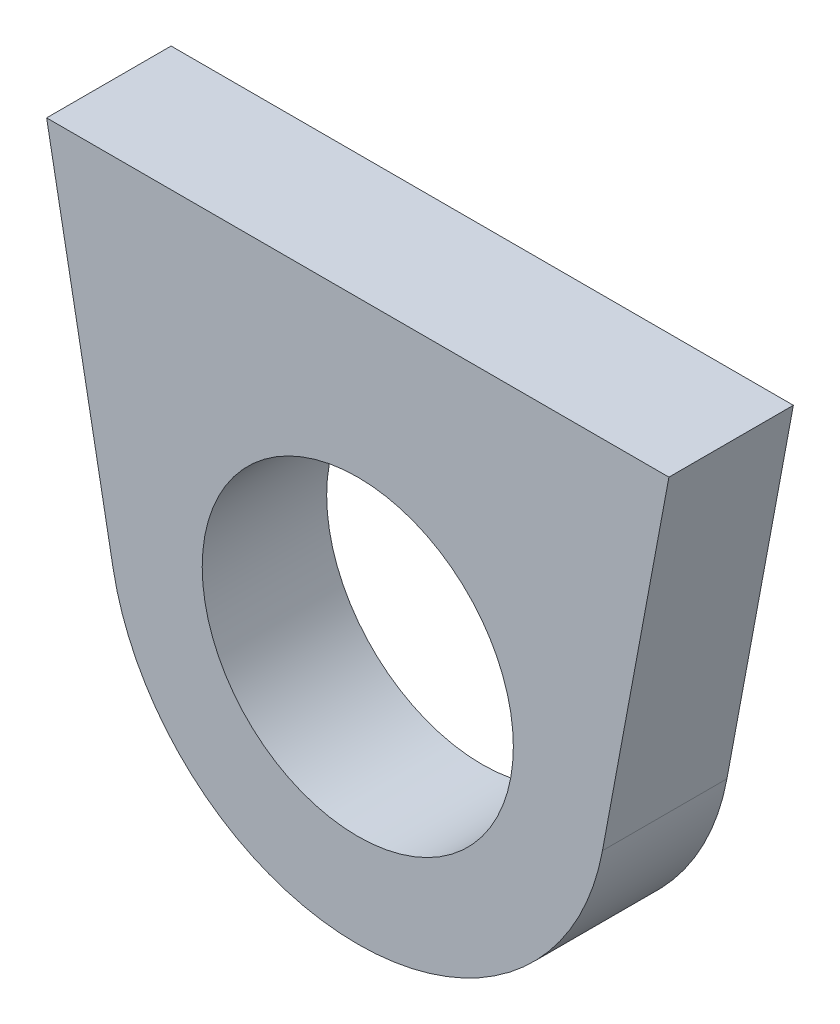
ISO-10303-21;
HEADER;
FILE_DESCRIPTION(('STEP AP214'),'2;1');
FILE_NAME('part.step','',(''),(''),'','','');
FILE_SCHEMA(('AUTOMOTIVE_DESIGN { 1 0 10303 214 1 1 1 1 }'));
ENDSEC;
DATA;
#1=APPLICATION_CONTEXT('core data for automotive mechanical design processes');
#2=APPLICATION_PROTOCOL_DEFINITION('international standard','automotive_design',2000,#1);
#3=PRODUCT_CONTEXT('',#1,'mechanical');
#4=PRODUCT('Part','Part','',(#3));
#5=PRODUCT_RELATED_PRODUCT_CATEGORY('part','',(#4));
#6=PRODUCT_DEFINITION_FORMATION('','',#4);
#7=PRODUCT_DEFINITION_CONTEXT('part definition',#1,'design');
#8=PRODUCT_DEFINITION('design','',#6,#7);
#9=PRODUCT_DEFINITION_SHAPE('','',#8);
#10=(LENGTH_UNIT() NAMED_UNIT(*) SI_UNIT(.MILLI.,.METRE.));
#11=(NAMED_UNIT(*) PLANE_ANGLE_UNIT() SI_UNIT($,.RADIAN.));
#12=(NAMED_UNIT(*) SI_UNIT($,.STERADIAN.) SOLID_ANGLE_UNIT());
#13=UNCERTAINTY_MEASURE_WITH_UNIT(LENGTH_MEASURE(1.E-05),#10,'distance_accuracy_value','');
#14=(GEOMETRIC_REPRESENTATION_CONTEXT(3) GLOBAL_UNCERTAINTY_ASSIGNED_CONTEXT((#13)) GLOBAL_UNIT_ASSIGNED_CONTEXT((#10,
#11,#12)) REPRESENTATION_CONTEXT('',''));
#15=CARTESIAN_POINT('',(0.,0.,0.));
#16=DIRECTION('',(0.,0.,1.));
#17=DIRECTION('',(1.,0.,0.));
#18=AXIS2_PLACEMENT_3D('',#15,#16,#17);
#19=CARTESIAN_POINT('',(0.,0.,40.));
#20=DIRECTION('',(0.,0.,1.));
#21=DIRECTION('',(1.,0.,0.));
#22=AXIS2_PLACEMENT_3D('',#19,#20,#21);
#23=PLANE('',#22);
#24=CARTESIAN_POINT('',(0.,0.,40.));
#25=DIRECTION('',(0.,0.,1.));
#26=DIRECTION('',(1.,0.,0.));
#27=AXIS2_PLACEMENT_3D('',#24,#25,#26);
#28=CIRCLE('',#27,80.);
#29=CARTESIAN_POINT('',(-78.6476151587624,-14.6476151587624,40.));
#30=VERTEX_POINT('',#29);
#31=CARTESIAN_POINT('',(78.6476151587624,-14.6476151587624,40.));
#32=VERTEX_POINT('',#31);
#33=EDGE_CURVE('E94',#30,#32,#28,.T.);
#34=ORIENTED_EDGE('',*,*,#33,.T.);
#35=DIRECTION('',(0.18309518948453,0.98309518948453,0.));
#36=VECTOR('',#35,1.);
#37=CARTESIAN_POINT('',(100.,100.,40.));
#38=LINE('',#37,#36);
#39=CARTESIAN_POINT('',(100.,100.,40.));
#40=VERTEX_POINT('',#39);
#41=EDGE_CURVE('E89',#32,#40,#38,.T.);
#42=ORIENTED_EDGE('',*,*,#41,.T.);
#43=DIRECTION('',(-1.,0.,0.));
#44=VECTOR('',#43,1.);
#45=CARTESIAN_POINT('',(-100.,100.,40.));
#46=LINE('',#45,#44);
#47=CARTESIAN_POINT('',(-100.,100.,40.));
#48=VERTEX_POINT('',#47);
#49=EDGE_CURVE('E92',#40,#48,#46,.T.);
#50=ORIENTED_EDGE('',*,*,#49,.T.);
#51=DIRECTION('',(0.18309518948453,-0.98309518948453,0.));
#52=VECTOR('',#51,1.);
#53=CARTESIAN_POINT('',(-78.6476151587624,-14.6476151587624,40.));
#54=LINE('',#53,#52);
#55=EDGE_CURVE('E59',#48,#30,#54,.T.);
#56=ORIENTED_EDGE('',*,*,#55,.T.);
#57=EDGE_LOOP('',(#34,#42,#50,#56));
#58=FACE_BOUND('',#57,.T.);
#59=CARTESIAN_POINT('',(0.,0.,40.));
#60=DIRECTION('',(0.,0.,1.));
#61=DIRECTION('',(1.,0.,0.));
#62=AXIS2_PLACEMENT_3D('',#59,#60,#61);
#63=CIRCLE('',#62,50.);
#64=CARTESIAN_POINT('',(50.,0.,40.));
#65=VERTEX_POINT('',#64);
#66=EDGE_CURVE('E109',#65,#65,#63,.T.);
#67=ORIENTED_EDGE('',*,*,#66,.F.);
#68=EDGE_LOOP('',(#67));
#69=FACE_BOUND('',#68,.T.);
#70=ADVANCED_FACE('F42',(#58,#69),#23,.T.);
#71=CARTESIAN_POINT('',(0.,0.,0.));
#72=DIRECTION('',(0.,0.,1.));
#73=DIRECTION('',(1.,0.,0.));
#74=AXIS2_PLACEMENT_3D('',#71,#72,#73);
#75=PLANE('',#74);
#76=CARTESIAN_POINT('',(0.,0.,0.));
#77=DIRECTION('',(0.,0.,1.));
#78=DIRECTION('',(1.,0.,0.));
#79=AXIS2_PLACEMENT_3D('',#76,#77,#78);
#80=CIRCLE('',#79,80.);
#81=CARTESIAN_POINT('',(-78.6476151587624,-14.6476151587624,0.));
#82=VERTEX_POINT('',#81);
#83=CARTESIAN_POINT('',(78.6476151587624,-14.6476151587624,0.));
#84=VERTEX_POINT('',#83);
#85=EDGE_CURVE('E106',#82,#84,#80,.T.);
#86=ORIENTED_EDGE('',*,*,#85,.F.);
#87=DIRECTION('',(0.18309518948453,-0.98309518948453,0.));
#88=VECTOR('',#87,1.);
#89=CARTESIAN_POINT('',(-78.6476151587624,-14.6476151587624,0.));
#90=LINE('',#89,#88);
#91=CARTESIAN_POINT('',(-100.,100.,0.));
#92=VERTEX_POINT('',#91);
#93=EDGE_CURVE('E82',#92,#82,#90,.T.);
#94=ORIENTED_EDGE('',*,*,#93,.F.);
#95=DIRECTION('',(-1.,0.,0.));
#96=VECTOR('',#95,1.);
#97=CARTESIAN_POINT('',(-100.,100.,0.));
#98=LINE('',#97,#96);
#99=CARTESIAN_POINT('',(100.,100.,0.));
#100=VERTEX_POINT('',#99);
#101=EDGE_CURVE('E76',#100,#92,#98,.T.);
#102=ORIENTED_EDGE('',*,*,#101,.F.);
#103=DIRECTION('',(0.18309518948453,0.98309518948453,0.));
#104=VECTOR('',#103,1.);
#105=CARTESIAN_POINT('',(100.,100.,0.));
#106=LINE('',#105,#104);
#107=EDGE_CURVE('E98',#84,#100,#106,.T.);
#108=ORIENTED_EDGE('',*,*,#107,.F.);
#109=EDGE_LOOP('',(#86,#94,#102,#108));
#110=FACE_BOUND('',#109,.T.);
#111=CARTESIAN_POINT('',(0.,0.,0.));
#112=DIRECTION('',(0.,0.,1.));
#113=DIRECTION('',(1.,0.,0.));
#114=AXIS2_PLACEMENT_3D('',#111,#112,#113);
#115=CIRCLE('',#114,50.);
#116=CARTESIAN_POINT('',(50.,0.,0.));
#117=VERTEX_POINT('',#116);
#118=EDGE_CURVE('E121',#117,#117,#115,.T.);
#119=ORIENTED_EDGE('',*,*,#118,.T.);
#120=EDGE_LOOP('',(#119));
#121=FACE_BOUND('',#120,.T.);
#122=ADVANCED_FACE('F117',(#110,#121),#75,.F.);
#123=CARTESIAN_POINT('',(0.,0.,40.));
#124=DIRECTION('',(0.,0.,-1.));
#125=DIRECTION('',(-1.,0.,0.));
#126=AXIS2_PLACEMENT_3D('',#123,#124,#125);
#127=CYLINDRICAL_SURFACE('',#126,80.);
#128=ORIENTED_EDGE('',*,*,#85,.T.);
#129=DIRECTION('',(0.,0.,-1.));
#130=VECTOR('',#129,1.);
#131=CARTESIAN_POINT('',(78.6476151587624,-14.6476151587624,40.));
#132=LINE('',#131,#130);
#133=EDGE_CURVE('E11',#32,#84,#132,.T.);
#134=ORIENTED_EDGE('',*,*,#133,.F.);
#135=ORIENTED_EDGE('',*,*,#33,.F.);
#136=DIRECTION('',(0.,0.,-1.));
#137=VECTOR('',#136,1.);
#138=CARTESIAN_POINT('',(-78.6476151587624,-14.6476151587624,40.));
#139=LINE('',#138,#137);
#140=EDGE_CURVE('E102',#30,#82,#139,.T.);
#141=ORIENTED_EDGE('',*,*,#140,.T.);
#142=EDGE_LOOP('',(#128,#134,#135,#141));
#143=FACE_BOUND('',#142,.T.);
#144=ADVANCED_FACE('F44',(#143),#127,.T.);
#145=CARTESIAN_POINT('',(100.,100.,40.));
#146=DIRECTION('',(-0.98309518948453,0.18309518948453,0.));
#147=DIRECTION('',(-0.18309518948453,-0.98309518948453,0.));
#148=AXIS2_PLACEMENT_3D('',#145,#146,#147);
#149=PLANE('',#148);
#150=ORIENTED_EDGE('',*,*,#107,.T.);
#151=DIRECTION('',(0.,0.,-1.));
#152=VECTOR('',#151,1.);
#153=CARTESIAN_POINT('',(100.,100.,40.));
#154=LINE('',#153,#152);
#155=EDGE_CURVE('E51',#40,#100,#154,.T.);
#156=ORIENTED_EDGE('',*,*,#155,.F.);
#157=ORIENTED_EDGE('',*,*,#41,.F.);
#158=ORIENTED_EDGE('',*,*,#133,.T.);
#159=EDGE_LOOP('',(#150,#156,#157,#158));
#160=FACE_BOUND('',#159,.T.);
#161=ADVANCED_FACE('F97',(#160),#149,.F.);
#162=CARTESIAN_POINT('',(-100.,100.,40.));
#163=DIRECTION('',(0.,-1.,0.));
#164=DIRECTION('',(0.,0.,-1.));
#165=AXIS2_PLACEMENT_3D('',#162,#163,#164);
#166=PLANE('',#165);
#167=ORIENTED_EDGE('',*,*,#101,.T.);
#168=DIRECTION('',(0.,0.,-1.));
#169=VECTOR('',#168,1.);
#170=CARTESIAN_POINT('',(-100.,100.,40.));
#171=LINE('',#170,#169);
#172=EDGE_CURVE('E99',#48,#92,#171,.T.);
#173=ORIENTED_EDGE('',*,*,#172,.F.);
#174=ORIENTED_EDGE('',*,*,#49,.F.);
#175=ORIENTED_EDGE('',*,*,#155,.T.);
#176=EDGE_LOOP('',(#167,#173,#174,#175));
#177=FACE_BOUND('',#176,.T.);
#178=ADVANCED_FACE('F100',(#177),#166,.F.);
#179=CARTESIAN_POINT('',(-78.6476151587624,-14.6476151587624,40.));
#180=DIRECTION('',(0.98309518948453,0.18309518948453,0.));
#181=DIRECTION('',(-0.18309518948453,0.98309518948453,0.));
#182=AXIS2_PLACEMENT_3D('',#179,#180,#181);
#183=PLANE('',#182);
#184=ORIENTED_EDGE('',*,*,#93,.T.);
#185=ORIENTED_EDGE('',*,*,#140,.F.);
#186=ORIENTED_EDGE('',*,*,#55,.F.);
#187=ORIENTED_EDGE('',*,*,#172,.T.);
#188=EDGE_LOOP('',(#184,#185,#186,#187));
#189=FACE_BOUND('',#188,.T.);
#190=ADVANCED_FACE('F114',(#189),#183,.F.);
#191=CARTESIAN_POINT('',(0.,0.,40.));
#192=DIRECTION('',(0.,0.,-1.));
#193=DIRECTION('',(-1.,0.,0.));
#194=AXIS2_PLACEMENT_3D('',#191,#192,#193);
#195=CYLINDRICAL_SURFACE('',#194,50.);
#196=ORIENTED_EDGE('',*,*,#66,.T.);
#197=EDGE_LOOP('',(#196));
#198=FACE_BOUND('',#197,.T.);
#199=ORIENTED_EDGE('',*,*,#118,.F.);
#200=EDGE_LOOP('',(#199));
#201=FACE_BOUND('',#200,.T.);
#202=ADVANCED_FACE('F127',(#198,#201),#195,.F.);
#203=CLOSED_SHELL('',(#70,#122,#144,#161,#178,#190,#202));
#204=MANIFOLD_SOLID_BREP('B2',#203);
#205=ADVANCED_BREP_SHAPE_REPRESENTATION('',(#18,#204),#14);
#206=SHAPE_DEFINITION_REPRESENTATION(#9,#205);
ENDSEC;
END-ISO-10303-21;
